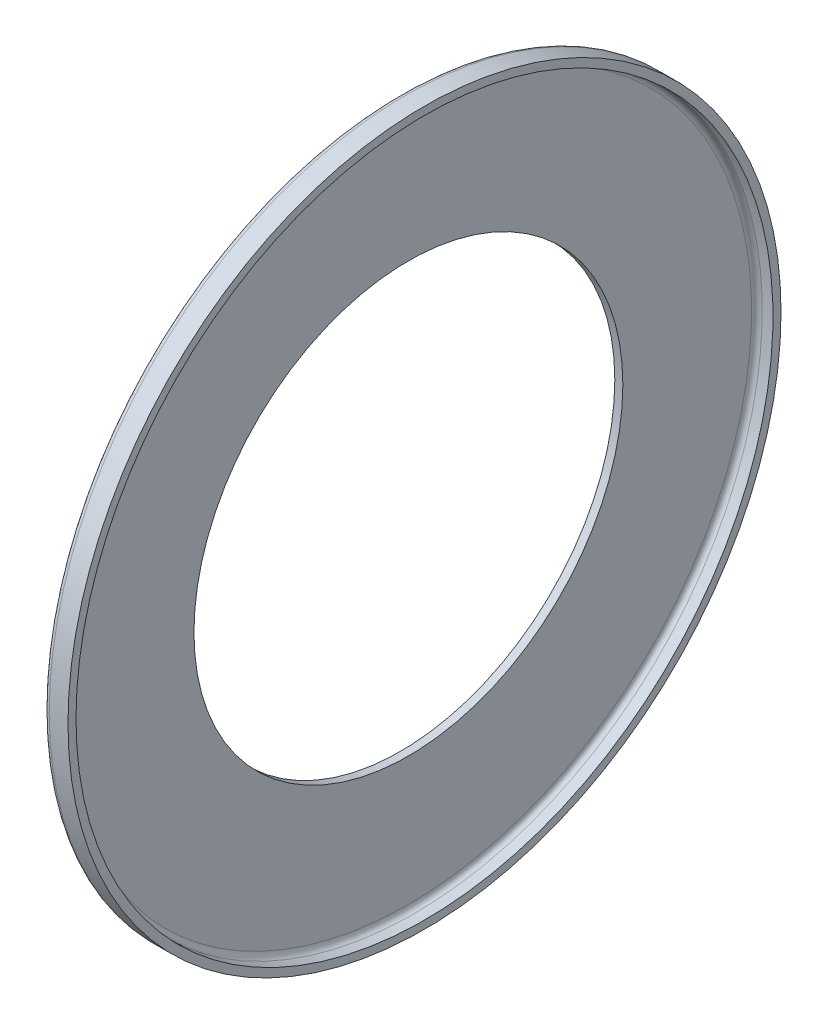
ISO-10303-21;
HEADER;
FILE_DESCRIPTION(('STEP AP214'),'2;1');
FILE_NAME('part.step','',(''),(''),'','','');
FILE_SCHEMA(('AUTOMOTIVE_DESIGN { 1 0 10303 214 1 1 1 1 }'));
ENDSEC;
DATA;
#1=APPLICATION_CONTEXT('core data for automotive mechanical design processes');
#2=APPLICATION_PROTOCOL_DEFINITION('international standard','automotive_design',2000,#1);
#3=PRODUCT_CONTEXT('',#1,'mechanical');
#4=PRODUCT('Part','Part','',(#3));
#5=PRODUCT_RELATED_PRODUCT_CATEGORY('part','',(#4));
#6=PRODUCT_DEFINITION_FORMATION('','',#4);
#7=PRODUCT_DEFINITION_CONTEXT('part definition',#1,'design');
#8=PRODUCT_DEFINITION('design','',#6,#7);
#9=PRODUCT_DEFINITION_SHAPE('','',#8);
#10=(LENGTH_UNIT() NAMED_UNIT(*) SI_UNIT(.MILLI.,.METRE.));
#11=(NAMED_UNIT(*) PLANE_ANGLE_UNIT() SI_UNIT($,.RADIAN.));
#12=(NAMED_UNIT(*) SI_UNIT($,.STERADIAN.) SOLID_ANGLE_UNIT());
#13=UNCERTAINTY_MEASURE_WITH_UNIT(LENGTH_MEASURE(1.E-05),#10,'distance_accuracy_value','');
#14=(GEOMETRIC_REPRESENTATION_CONTEXT(3) GLOBAL_UNCERTAINTY_ASSIGNED_CONTEXT((#13)) GLOBAL_UNIT_ASSIGNED_CONTEXT((#10,
#11,#12)) REPRESENTATION_CONTEXT('',''));
#15=CARTESIAN_POINT('',(0.,0.,0.));
#16=DIRECTION('',(0.,0.,1.));
#17=DIRECTION('',(1.,0.,0.));
#18=AXIS2_PLACEMENT_3D('',#15,#16,#17);
#19=CARTESIAN_POINT('',(-28.5,64.,0.));
#20=DIRECTION('',(-1.,0.,0.));
#21=DIRECTION('',(0.,0.,1.));
#22=AXIS2_PLACEMENT_3D('',#19,#20,#21);
#23=PLANE('',#22);
#24=CARTESIAN_POINT('',(-28.5,0.,0.));
#25=DIRECTION('',(-1.,0.,0.));
#26=DIRECTION('',(0.,0.,1.));
#27=AXIS2_PLACEMENT_3D('',#24,#25,#26);
#28=CIRCLE('',#27,64.);
#29=CARTESIAN_POINT('',(-28.5,0.,64.));
#30=VERTEX_POINT('',#29);
#31=EDGE_CURVE('E10',#30,#30,#28,.T.);
#32=ORIENTED_EDGE('',*,*,#31,.F.);
#33=EDGE_LOOP('',(#32));
#34=FACE_BOUND('',#33,.T.);
#35=CARTESIAN_POINT('',(-28.5,0.,0.));
#36=DIRECTION('',(-1.,0.,0.));
#37=DIRECTION('',(0.,0.,1.));
#38=AXIS2_PLACEMENT_3D('',#35,#36,#37);
#39=CIRCLE('',#38,40.);
#40=CARTESIAN_POINT('',(-28.5,0.,40.));
#41=VERTEX_POINT('',#40);
#42=EDGE_CURVE('E57',#41,#41,#39,.T.);
#43=ORIENTED_EDGE('',*,*,#42,.T.);
#44=EDGE_LOOP('',(#43));
#45=FACE_BOUND('',#44,.T.);
#46=ADVANCED_FACE('F29',(#34,#45),#23,.F.);
#47=CARTESIAN_POINT('',(-27.5,0.,0.));
#48=DIRECTION('',(-1.,0.,0.));
#49=DIRECTION('',(0.,0.,1.));
#50=AXIS2_PLACEMENT_3D('',#47,#48,#49);
#51=TOROIDAL_SURFACE('',#50,64.,1.);
#52=CARTESIAN_POINT('',(-27.5,0.,0.));
#53=DIRECTION('',(-1.,0.,0.));
#54=DIRECTION('',(0.,0.,1.));
#55=AXIS2_PLACEMENT_3D('',#52,#53,#54);
#56=CIRCLE('',#55,65.);
#57=CARTESIAN_POINT('',(-27.5,0.,65.));
#58=VERTEX_POINT('',#57);
#59=EDGE_CURVE('E35',#58,#58,#56,.T.);
#60=ORIENTED_EDGE('',*,*,#59,.F.);
#61=EDGE_LOOP('',(#60));
#62=FACE_BOUND('',#61,.T.);
#63=ORIENTED_EDGE('',*,*,#31,.T.);
#64=EDGE_LOOP('',(#63));
#65=FACE_BOUND('',#64,.T.);
#66=ADVANCED_FACE('F94',(#62,#65),#51,.F.);
#67=CARTESIAN_POINT('',(-100.,0.,0.));
#68=DIRECTION('',(-1.,0.,0.));
#69=DIRECTION('',(0.,0.,1.));
#70=AXIS2_PLACEMENT_3D('',#67,#68,#69);
#71=CYLINDRICAL_SURFACE('',#70,65.);
#72=CARTESIAN_POINT('',(-25.5,0.,0.));
#73=DIRECTION('',(-1.,0.,0.));
#74=DIRECTION('',(0.,0.,1.));
#75=AXIS2_PLACEMENT_3D('',#72,#73,#74);
#76=CIRCLE('',#75,65.);
#77=CARTESIAN_POINT('',(-25.5,0.,65.));
#78=VERTEX_POINT('',#77);
#79=EDGE_CURVE('E39',#78,#78,#76,.T.);
#80=ORIENTED_EDGE('',*,*,#79,.F.);
#81=EDGE_LOOP('',(#80));
#82=FACE_BOUND('',#81,.T.);
#83=ORIENTED_EDGE('',*,*,#59,.T.);
#84=EDGE_LOOP('',(#83));
#85=FACE_BOUND('',#84,.T.);
#86=ADVANCED_FACE('F89',(#82,#85),#71,.F.);
#87=CARTESIAN_POINT('',(-25.5,66.5,0.));
#88=DIRECTION('',(-1.,0.,0.));
#89=DIRECTION('',(0.,0.,1.));
#90=AXIS2_PLACEMENT_3D('',#87,#88,#89);
#91=PLANE('',#90);
#92=CARTESIAN_POINT('',(-25.5,0.,0.));
#93=DIRECTION('',(-1.,0.,0.));
#94=DIRECTION('',(0.,0.,1.));
#95=AXIS2_PLACEMENT_3D('',#92,#93,#94);
#96=CIRCLE('',#95,66.5);
#97=CARTESIAN_POINT('',(-25.5,0.,66.5));
#98=VERTEX_POINT('',#97);
#99=EDGE_CURVE('E43',#98,#98,#96,.T.);
#100=ORIENTED_EDGE('',*,*,#99,.F.);
#101=EDGE_LOOP('',(#100));
#102=FACE_BOUND('',#101,.T.);
#103=ORIENTED_EDGE('',*,*,#79,.T.);
#104=EDGE_LOOP('',(#103));
#105=FACE_BOUND('',#104,.T.);
#106=ADVANCED_FACE('F83',(#102,#105),#91,.F.);
#107=CARTESIAN_POINT('',(-100.,0.,0.));
#108=DIRECTION('',(-1.,0.,0.));
#109=DIRECTION('',(0.,0.,1.));
#110=AXIS2_PLACEMENT_3D('',#107,#108,#109);
#111=CYLINDRICAL_SURFACE('',#110,66.5);
#112=CARTESIAN_POINT('',(-29.,0.,0.));
#113=DIRECTION('',(-1.,0.,0.));
#114=DIRECTION('',(0.,0.,1.));
#115=AXIS2_PLACEMENT_3D('',#112,#113,#114);
#116=CIRCLE('',#115,66.5);
#117=CARTESIAN_POINT('',(-29.,0.,66.5));
#118=VERTEX_POINT('',#117);
#119=EDGE_CURVE('E48',#118,#118,#116,.T.);
#120=ORIENTED_EDGE('',*,*,#119,.F.);
#121=EDGE_LOOP('',(#120));
#122=FACE_BOUND('',#121,.T.);
#123=ORIENTED_EDGE('',*,*,#99,.T.);
#124=EDGE_LOOP('',(#123));
#125=FACE_BOUND('',#124,.T.);
#126=ADVANCED_FACE('F77',(#122,#125),#111,.T.);
#127=CARTESIAN_POINT('',(-29.,0.,0.));
#128=DIRECTION('',(-1.,0.,0.));
#129=DIRECTION('',(0.,0.,1.));
#130=AXIS2_PLACEMENT_3D('',#127,#128,#129);
#131=TOROIDAL_SURFACE('',#130,65.5,1.);
#132=CARTESIAN_POINT('',(-30.,0.,0.));
#133=DIRECTION('',(-1.,0.,0.));
#134=DIRECTION('',(0.,0.,1.));
#135=AXIS2_PLACEMENT_3D('',#132,#133,#134);
#136=CIRCLE('',#135,65.5);
#137=CARTESIAN_POINT('',(-30.,0.,65.5));
#138=VERTEX_POINT('',#137);
#139=EDGE_CURVE('E51',#138,#138,#136,.T.);
#140=ORIENTED_EDGE('',*,*,#139,.F.);
#141=EDGE_LOOP('',(#140));
#142=FACE_BOUND('',#141,.T.);
#143=ORIENTED_EDGE('',*,*,#119,.T.);
#144=EDGE_LOOP('',(#143));
#145=FACE_BOUND('',#144,.T.);
#146=ADVANCED_FACE('F71',(#142,#145),#131,.T.);
#147=CARTESIAN_POINT('',(-30.,65.5,0.));
#148=DIRECTION('',(1.,0.,0.));
#149=DIRECTION('',(0.,0.,-1.));
#150=AXIS2_PLACEMENT_3D('',#147,#148,#149);
#151=PLANE('',#150);
#152=CARTESIAN_POINT('',(-30.,0.,0.));
#153=DIRECTION('',(-1.,0.,0.));
#154=DIRECTION('',(0.,0.,1.));
#155=AXIS2_PLACEMENT_3D('',#152,#153,#154);
#156=CIRCLE('',#155,40.);
#157=CARTESIAN_POINT('',(-30.,0.,40.));
#158=VERTEX_POINT('',#157);
#159=EDGE_CURVE('E54',#158,#158,#156,.T.);
#160=ORIENTED_EDGE('',*,*,#159,.F.);
#161=EDGE_LOOP('',(#160));
#162=FACE_BOUND('',#161,.T.);
#163=ORIENTED_EDGE('',*,*,#139,.T.);
#164=EDGE_LOOP('',(#163));
#165=FACE_BOUND('',#164,.T.);
#166=ADVANCED_FACE('F65',(#162,#165),#151,.F.);
#167=CARTESIAN_POINT('',(-100.,0.,0.));
#168=DIRECTION('',(-1.,0.,0.));
#169=DIRECTION('',(0.,0.,1.));
#170=AXIS2_PLACEMENT_3D('',#167,#168,#169);
#171=CYLINDRICAL_SURFACE('',#170,40.);
#172=ORIENTED_EDGE('',*,*,#42,.F.);
#173=EDGE_LOOP('',(#172));
#174=FACE_BOUND('',#173,.T.);
#175=ORIENTED_EDGE('',*,*,#159,.T.);
#176=EDGE_LOOP('',(#175));
#177=FACE_BOUND('',#176,.T.);
#178=ADVANCED_FACE('F62',(#174,#177),#171,.F.);
#179=CLOSED_SHELL('',(#46,#66,#86,#106,#126,#146,#166,#178));
#180=MANIFOLD_SOLID_BREP('B2',#179);
#181=ADVANCED_BREP_SHAPE_REPRESENTATION('',(#18,#180),#14);
#182=SHAPE_DEFINITION_REPRESENTATION(#9,#181);
ENDSEC;
END-ISO-10303-21;
